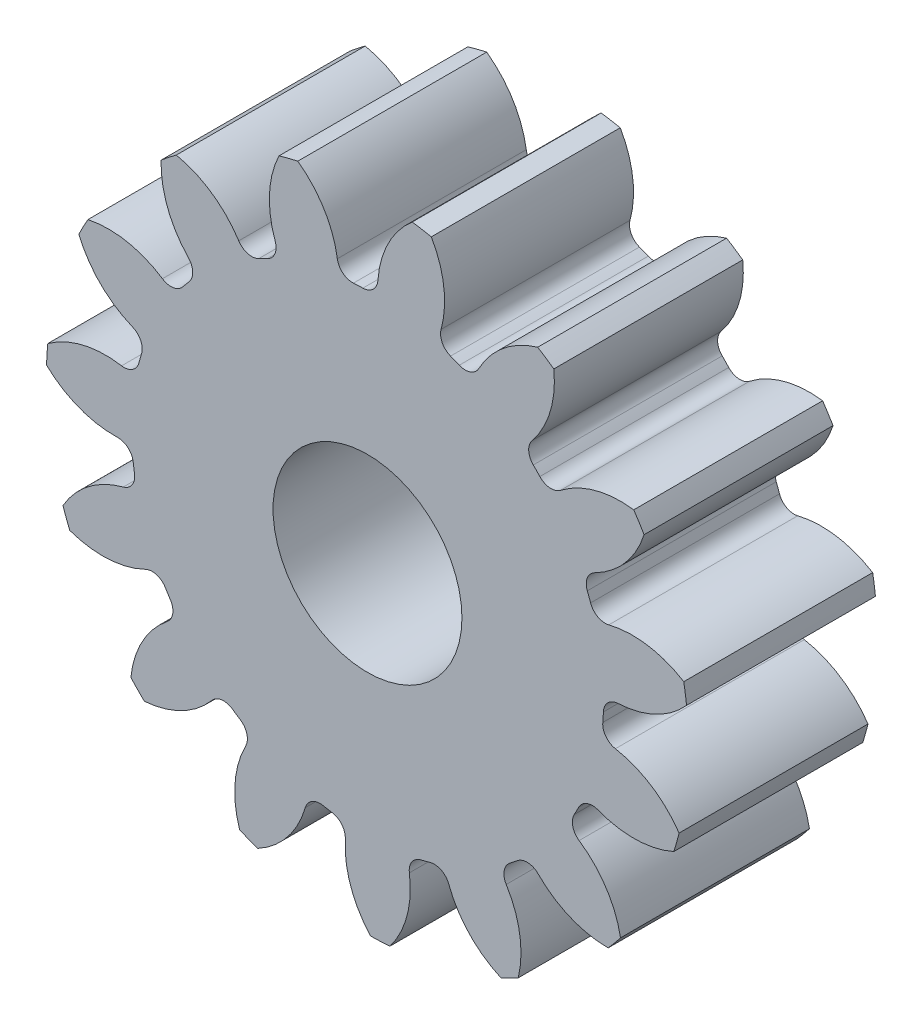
from build123d import *

# Parameters (mm, degrees)
SKETCH3_R         = 172.72
GEARBODY_DEPTH    = 101.6
TOOTHCUT_DEPTH    = 265.550480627
CIRPATTERN1_COUNT = 15
BOREDIA_R         = 50.8
BORE_DEPTH        = 12700


with BuildPart() as part:
    # Sketch3 → gearBody (new body)
    with BuildSketch(Plane.XY):
        Circle(SKETCH3_R)
    extrude(amount=GEARBODY_DEPTH)

    # Sketch2 → toothCut (cut, through all)
    with BuildSketch(Plane.XY):
        with BuildLine():
            ThreePointArc((126.539791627, -10.801904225), (126.730250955, -8.273058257), (126.870177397, -5.740913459))
            ThreePointArc((126.870177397, -5.740913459), (129.28079441, -0.270046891), (134.748997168, 2.146606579))
            ThreePointArc((134.748997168, 2.146606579), (155.707834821, 7.568366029), (172.72, 20.95696518))
            ThreePointArc((172.72, 20.95696518), (173.617211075, -11.333878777), (168.529557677, -43.234025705))
            ThreePointArc((168.529557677, -43.234025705), (153.402395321, -27.747343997), (133.326305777, -19.646789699))
            ThreePointArc((133.326305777, -19.646789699), (128.218695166, -16.539738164), (126.539791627, -10.801904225))
        make_face()
    toothcut = extrude(amount=TOOTHCUT_DEPTH, mode=Mode.SUBTRACT)

    # CirPattern1: toothCut ×15 about axis
    cirpattern1_axis = Axis((0, 0, 0), (0, 0, 1))
    for i in range(1, CIRPATTERN1_COUNT):
        add(toothcut.rotate(cirpattern1_axis, i * 360 / CIRPATTERN1_COUNT), mode=Mode.SUBTRACT)

    # boreDia → bore (cut, symmetric)
    with BuildSketch(Plane.XY):
        Circle(BOREDIA_R)
    extrude(amount=BORE_DEPTH, both=True, mode=Mode.SUBTRACT)


solid = part.part
